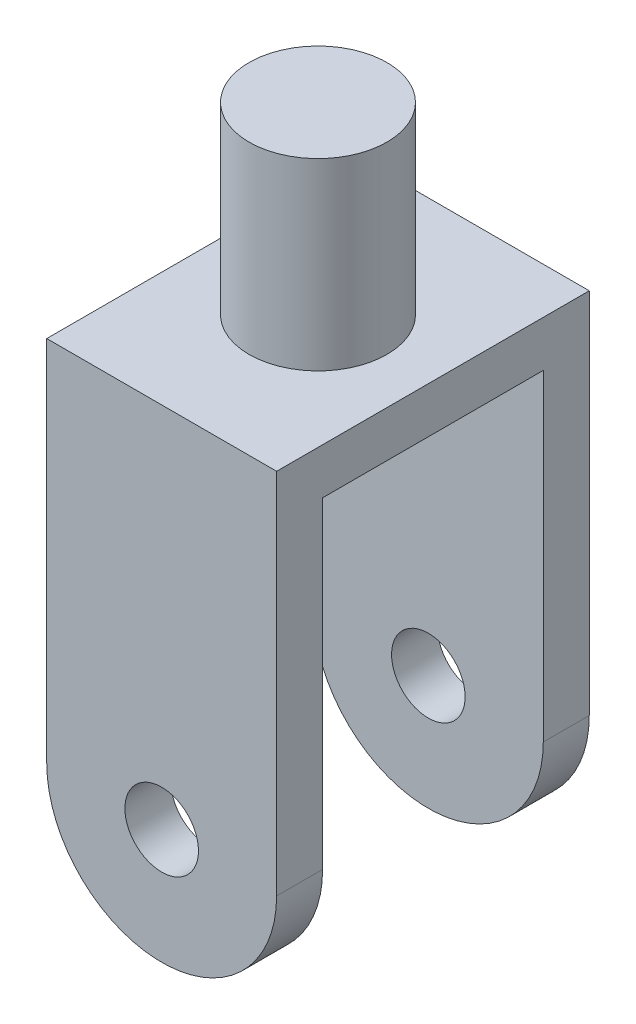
from build123d import *

# Parameters (mm, degrees)
SKETCH2_R               = 10.16
BOSS_EXTRUDE1_DEPTH     = 86.36
CUT_EXTRUDE1_DEPTH      = 148.691772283
CUT_EXTRUDE1_DEPTH_BACK = 148.691772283
SKETCH3_W               = 60.96
SKETCH3_H               = 120.65
SKETCH5_R               = 19.05
BOSS_EXTRUDE2_DEPTH     = 50.8


with BuildPart() as part:
    # Sketch2 → Boss-Extrude1 (new body)
    with BuildSketch(Plane.XY):
        with BuildLine():
            Line((0, 0), (0, 101.6))
            Line((0, 101.6), (63.5, 101.6))
            Line((63.5, 101.6), (63.5, 0))
            ThreePointArc((63.5, 0), (31.75, -31.75), (0, 0))
        make_face()
        with Locations((31.75, 0)):
            Circle(SKETCH2_R, mode=Mode.SUBTRACT)
    extrude(amount=BOSS_EXTRUDE1_DEPTH)

    # Sketch3 → Cut-Extrude1 (cut, two sides: drawn at the far end of the back side and taken through both)
    with BuildSketch(Plane(origin=(63.5, 0, 0), x_dir=(0, 0, -1), z_dir=(1, 0, 0)).offset(-CUT_EXTRUDE1_DEPTH_BACK)):
        with Locations((-43.18, 28.575)):
            Rectangle(SKETCH3_W, SKETCH3_H)
    extrude(amount=CUT_EXTRUDE1_DEPTH + CUT_EXTRUDE1_DEPTH_BACK, mode=Mode.SUBTRACT)

    # Sketch5 → Boss-Extrude2 (add)
    with BuildSketch(Plane(origin=(0, 101.6, 0), x_dir=(1, 0, 0), z_dir=(0, 1, 0))):
        with Locations(Location((31.75, -43.18, 0), (0, 0, 270))):
            Circle(SKETCH5_R)
    extrude(amount=BOSS_EXTRUDE2_DEPTH)


solid = part.part
